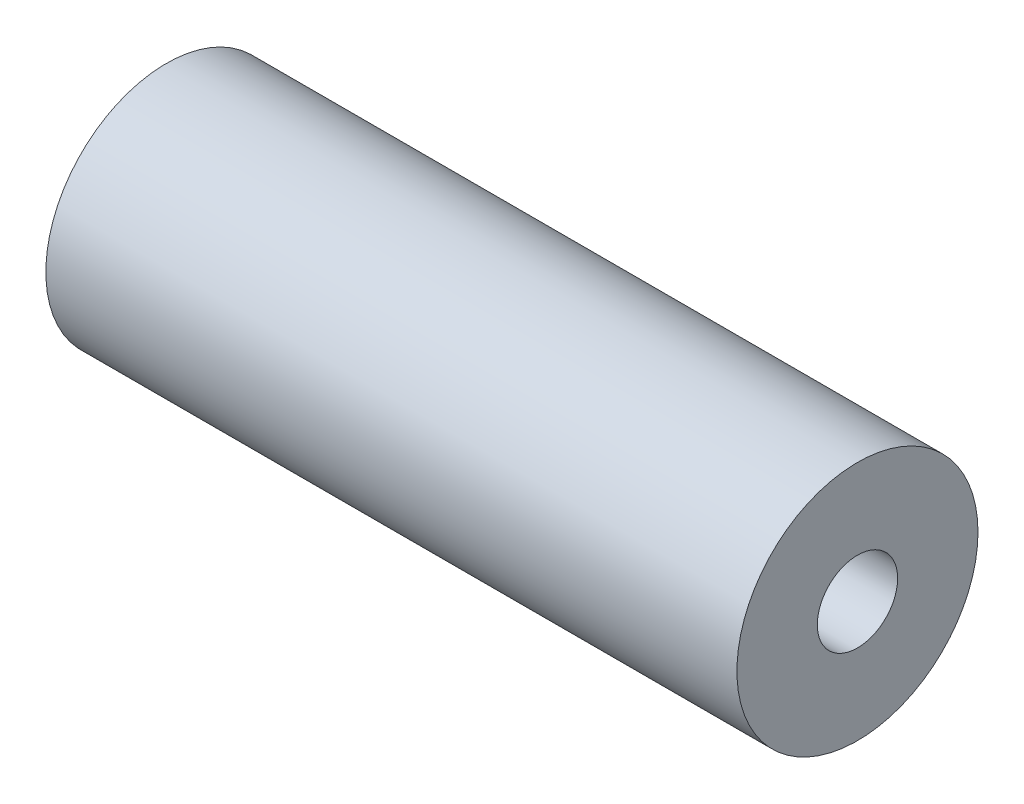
ISO-10303-21;
HEADER;
FILE_DESCRIPTION(('STEP AP214'),'2;1');
FILE_NAME('part.step','',(''),(''),'','','');
FILE_SCHEMA(('AUTOMOTIVE_DESIGN { 1 0 10303 214 1 1 1 1 }'));
ENDSEC;
DATA;
#1=APPLICATION_CONTEXT('core data for automotive mechanical design processes');
#2=APPLICATION_PROTOCOL_DEFINITION('international standard','automotive_design',2000,#1);
#3=PRODUCT_CONTEXT('',#1,'mechanical');
#4=PRODUCT('Part','Part','',(#3));
#5=PRODUCT_RELATED_PRODUCT_CATEGORY('part','',(#4));
#6=PRODUCT_DEFINITION_FORMATION('','',#4);
#7=PRODUCT_DEFINITION_CONTEXT('part definition',#1,'design');
#8=PRODUCT_DEFINITION('design','',#6,#7);
#9=PRODUCT_DEFINITION_SHAPE('','',#8);
#10=(LENGTH_UNIT() NAMED_UNIT(*) SI_UNIT(.MILLI.,.METRE.));
#11=(NAMED_UNIT(*) PLANE_ANGLE_UNIT() SI_UNIT($,.RADIAN.));
#12=(NAMED_UNIT(*) SI_UNIT($,.STERADIAN.) SOLID_ANGLE_UNIT());
#13=UNCERTAINTY_MEASURE_WITH_UNIT(LENGTH_MEASURE(1.E-05),#10,'distance_accuracy_value','');
#14=(GEOMETRIC_REPRESENTATION_CONTEXT(3) GLOBAL_UNCERTAINTY_ASSIGNED_CONTEXT((#13)) GLOBAL_UNIT_ASSIGNED_CONTEXT((#10,
#11,#12)) REPRESENTATION_CONTEXT('',''));
#15=CARTESIAN_POINT('',(0.,0.,0.));
#16=DIRECTION('',(0.,0.,1.));
#17=DIRECTION('',(1.,0.,0.));
#18=AXIS2_PLACEMENT_3D('',#15,#16,#17);
#19=CARTESIAN_POINT('',(43.,0.,0.));
#20=DIRECTION('',(1.,0.,0.));
#21=DIRECTION('',(0.,0.,-1.));
#22=AXIS2_PLACEMENT_3D('',#19,#20,#21);
#23=PLANE('',#22);
#24=CARTESIAN_POINT('',(43.,0.,0.));
#25=DIRECTION('',(1.,0.,0.));
#26=DIRECTION('',(0.,0.,-1.));
#27=AXIS2_PLACEMENT_3D('',#24,#25,#26);
#28=CIRCLE('',#27,7.5);
#29=CARTESIAN_POINT('',(43.,0.,-7.5));
#30=VERTEX_POINT('',#29);
#31=EDGE_CURVE('E10',#30,#30,#28,.T.);
#32=ORIENTED_EDGE('',*,*,#31,.T.);
#33=EDGE_LOOP('',(#32));
#34=FACE_BOUND('',#33,.T.);
#35=CARTESIAN_POINT('',(43.,0.,0.));
#36=DIRECTION('',(1.,0.,0.));
#37=DIRECTION('',(0.,0.,-1.));
#38=AXIS2_PLACEMENT_3D('',#35,#36,#37);
#39=CIRCLE('',#38,2.5);
#40=CARTESIAN_POINT('',(43.,0.,-2.5));
#41=VERTEX_POINT('',#40);
#42=EDGE_CURVE('E48',#41,#41,#39,.T.);
#43=ORIENTED_EDGE('',*,*,#42,.F.);
#44=EDGE_LOOP('',(#43));
#45=FACE_BOUND('',#44,.T.);
#46=ADVANCED_FACE('F37',(#34,#45),#23,.T.);
#47=CARTESIAN_POINT('',(0.,0.,0.));
#48=DIRECTION('',(1.,0.,0.));
#49=DIRECTION('',(0.,0.,-1.));
#50=AXIS2_PLACEMENT_3D('',#47,#48,#49);
#51=PLANE('',#50);
#52=CARTESIAN_POINT('',(0.,0.,0.));
#53=DIRECTION('',(1.,0.,0.));
#54=DIRECTION('',(0.,0.,-1.));
#55=AXIS2_PLACEMENT_3D('',#52,#53,#54);
#56=CIRCLE('',#55,7.5);
#57=CARTESIAN_POINT('',(0.,0.,-7.5));
#58=VERTEX_POINT('',#57);
#59=EDGE_CURVE('E41',#58,#58,#56,.T.);
#60=ORIENTED_EDGE('',*,*,#59,.F.);
#61=EDGE_LOOP('',(#60));
#62=FACE_BOUND('',#61,.T.);
#63=CARTESIAN_POINT('',(0.,0.,0.));
#64=DIRECTION('',(1.,0.,0.));
#65=DIRECTION('',(0.,0.,-1.));
#66=AXIS2_PLACEMENT_3D('',#63,#64,#65);
#67=CIRCLE('',#66,2.5);
#68=CARTESIAN_POINT('',(0.,0.,-2.5));
#69=VERTEX_POINT('',#68);
#70=EDGE_CURVE('E50',#69,#69,#67,.T.);
#71=ORIENTED_EDGE('',*,*,#70,.T.);
#72=EDGE_LOOP('',(#71));
#73=FACE_BOUND('',#72,.T.);
#74=ADVANCED_FACE('F60',(#62,#73),#51,.F.);
#75=CARTESIAN_POINT('',(43.,0.,0.));
#76=DIRECTION('',(-1.,0.,0.));
#77=DIRECTION('',(0.,0.,1.));
#78=AXIS2_PLACEMENT_3D('',#75,#76,#77);
#79=CYLINDRICAL_SURFACE('',#78,7.5);
#80=ORIENTED_EDGE('',*,*,#31,.F.);
#81=EDGE_LOOP('',(#80));
#82=FACE_BOUND('',#81,.T.);
#83=ORIENTED_EDGE('',*,*,#59,.T.);
#84=EDGE_LOOP('',(#83));
#85=FACE_BOUND('',#84,.T.);
#86=ADVANCED_FACE('F39',(#82,#85),#79,.T.);
#87=CARTESIAN_POINT('',(43.,0.,0.));
#88=DIRECTION('',(-1.,0.,0.));
#89=DIRECTION('',(0.,0.,1.));
#90=AXIS2_PLACEMENT_3D('',#87,#88,#89);
#91=CYLINDRICAL_SURFACE('',#90,2.5);
#92=ORIENTED_EDGE('',*,*,#42,.T.);
#93=EDGE_LOOP('',(#92));
#94=FACE_BOUND('',#93,.T.);
#95=ORIENTED_EDGE('',*,*,#70,.F.);
#96=EDGE_LOOP('',(#95));
#97=FACE_BOUND('',#96,.T.);
#98=ADVANCED_FACE('F56',(#94,#97),#91,.F.);
#99=CLOSED_SHELL('',(#46,#74,#86,#98));
#100=MANIFOLD_SOLID_BREP('B2',#99);
#101=ADVANCED_BREP_SHAPE_REPRESENTATION('',(#18,#100),#14);
#102=SHAPE_DEFINITION_REPRESENTATION(#9,#101);
ENDSEC;
END-ISO-10303-21;
